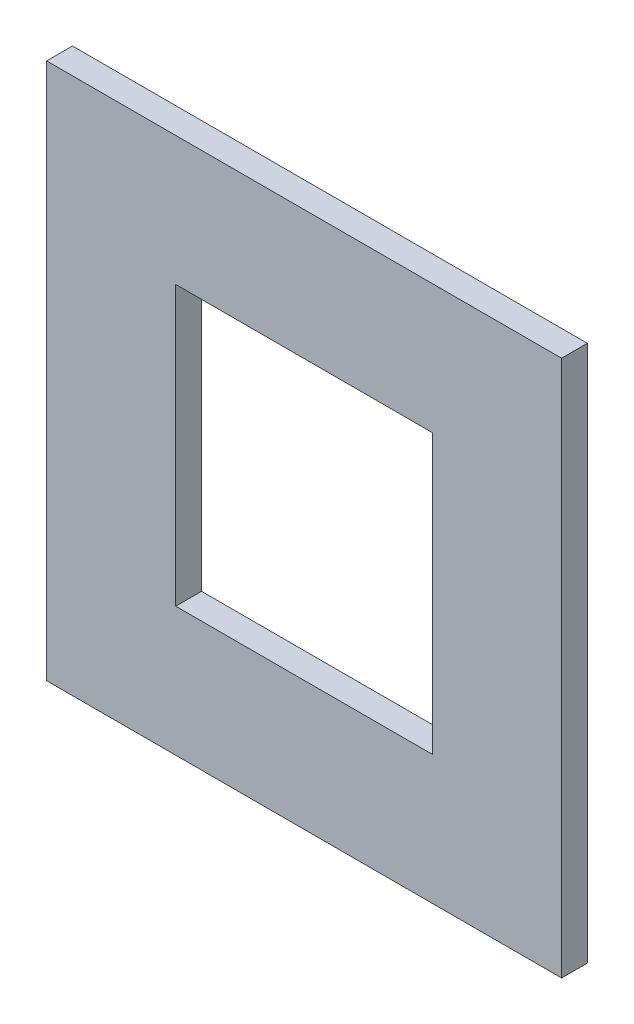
from build123d import *

# Parameters (mm, degrees)
SKETCH1_W           = 1407.485243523
SKETCH1_H           = 1128.959139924
SKETCH1_W_2         = 149.225
SKETCH1_H_2         = 161.925
BOSS_EXTRUDE1_DEPTH = 15
SKETCH2_W           = 1634.850849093
SKETCH2_H           = 1414.029762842
SKETCH2_W_2         = 299.225
SKETCH2_H_2         = 311.925
CUT_EXTRUDE1_DEPTH  = 1080.206832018


with BuildPart() as part:
    # Sketch1 → Boss-Extrude1 (new body)
    with BuildSketch(Plane.XY):
        with Locations((64.619518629, -193.202426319)):
            Rectangle(SKETCH1_W, SKETCH1_H)
        Rectangle(SKETCH1_W_2, SKETCH1_H_2, mode=Mode.SUBTRACT)
    extrude(amount=BOSS_EXTRUDE1_DEPTH)

    # Sketch2 → Cut-Extrude1 (cut, through all)
    with BuildSketch(Plane(origin=(0, 0, 0), x_dir=(-1, 0, 0), z_dir=(0, 0, -1))):
        with Locations((-17.147082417, -252.403097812)):
            Rectangle(SKETCH2_W, SKETCH2_H)
        Rectangle(SKETCH2_W_2, SKETCH2_H_2, mode=Mode.SUBTRACT)
    extrude(amount=-CUT_EXTRUDE1_DEPTH, mode=Mode.SUBTRACT)


solid = part.part
